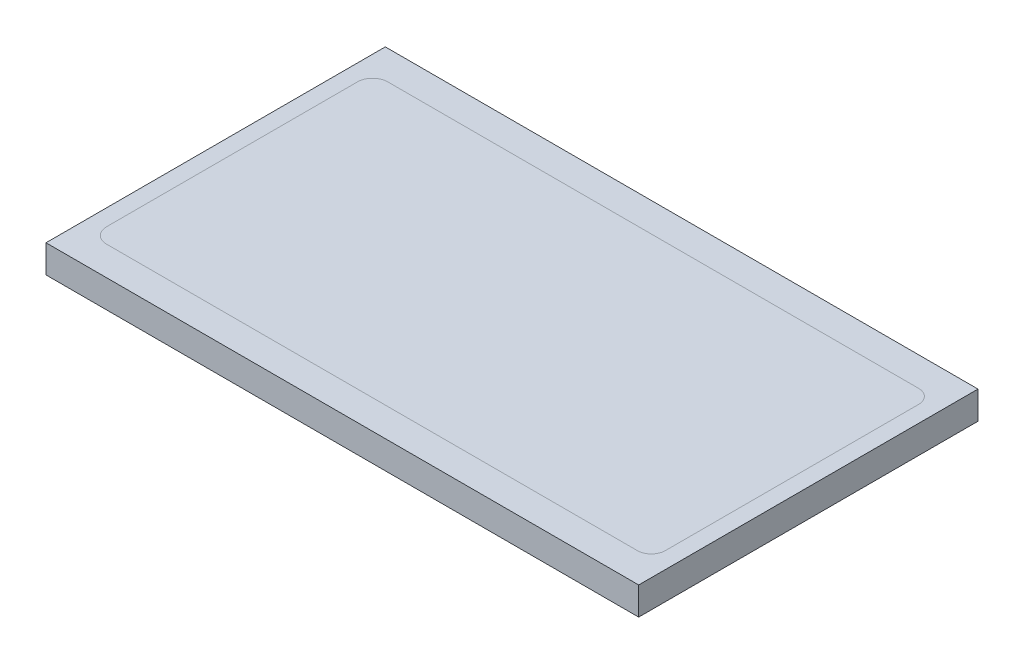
ISO-10303-21;
HEADER;
FILE_DESCRIPTION(('STEP AP214'),'2;1');
FILE_NAME('part.step','',(''),(''),'','','');
FILE_SCHEMA(('AUTOMOTIVE_DESIGN { 1 0 10303 214 1 1 1 1 }'));
ENDSEC;
DATA;
#1=APPLICATION_CONTEXT('core data for automotive mechanical design processes');
#2=APPLICATION_PROTOCOL_DEFINITION('international standard','automotive_design',2000,#1);
#3=PRODUCT_CONTEXT('',#1,'mechanical');
#4=PRODUCT('Part','Part','',(#3));
#5=PRODUCT_RELATED_PRODUCT_CATEGORY('part','',(#4));
#6=PRODUCT_DEFINITION_FORMATION('','',#4);
#7=PRODUCT_DEFINITION_CONTEXT('part definition',#1,'design');
#8=PRODUCT_DEFINITION('design','',#6,#7);
#9=PRODUCT_DEFINITION_SHAPE('','',#8);
#10=(LENGTH_UNIT() NAMED_UNIT(*) SI_UNIT(.MILLI.,.METRE.));
#11=(NAMED_UNIT(*) PLANE_ANGLE_UNIT() SI_UNIT($,.RADIAN.));
#12=(NAMED_UNIT(*) SI_UNIT($,.STERADIAN.) SOLID_ANGLE_UNIT());
#13=UNCERTAINTY_MEASURE_WITH_UNIT(LENGTH_MEASURE(1.E-05),#10,'distance_accuracy_value','');
#14=(GEOMETRIC_REPRESENTATION_CONTEXT(3) GLOBAL_UNCERTAINTY_ASSIGNED_CONTEXT((#13)) GLOBAL_UNIT_ASSIGNED_CONTEXT((#10,
#11,#12)) REPRESENTATION_CONTEXT('',''));
#15=CARTESIAN_POINT('',(0.,0.,0.));
#16=DIRECTION('',(0.,0.,1.));
#17=DIRECTION('',(1.,0.,0.));
#18=AXIS2_PLACEMENT_3D('',#15,#16,#17);
#19=CARTESIAN_POINT('',(-106.323036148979,7.27937640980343,-60.867504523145));
#20=DIRECTION('',(1.,0.,0.));
#21=DIRECTION('',(0.,0.,-1.));
#22=AXIS2_PLACEMENT_3D('',#19,#20,#21);
#23=PLANE('',#22);
#24=DIRECTION('',(0.,0.,1.));
#25=VECTOR('',#24,1.);
#26=CARTESIAN_POINT('',(-106.323036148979,-92.7206235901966,-60.867504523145));
#27=LINE('',#26,#25);
#28=CARTESIAN_POINT('',(-106.323036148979,-92.7206235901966,-60.867504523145));
#29=VERTEX_POINT('',#28);
#30=CARTESIAN_POINT('',(-106.323036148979,-92.7206235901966,60.867504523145));
#31=VERTEX_POINT('',#30);
#32=EDGE_CURVE('E59',#29,#31,#27,.T.);
#33=ORIENTED_EDGE('',*,*,#32,.F.);
#34=DIRECTION('',(0.,-1.,0.));
#35=VECTOR('',#34,1.);
#36=CARTESIAN_POINT('',(-106.323036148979,7.27937640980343,-60.867504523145));
#37=LINE('',#36,#35);
#38=CARTESIAN_POINT('',(-106.323036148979,-102.720623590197,-60.867504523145));
#39=VERTEX_POINT('',#38);
#40=EDGE_CURVE('E198',#29,#39,#37,.T.);
#41=ORIENTED_EDGE('',*,*,#40,.T.);
#42=DIRECTION('',(0.,0.,1.));
#43=VECTOR('',#42,1.);
#44=CARTESIAN_POINT('',(-106.323036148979,-102.720623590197,-60.867504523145));
#45=LINE('',#44,#43);
#46=CARTESIAN_POINT('',(-106.323036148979,-102.720623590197,60.867504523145));
#47=VERTEX_POINT('',#46);
#48=EDGE_CURVE('E186',#39,#47,#45,.T.);
#49=ORIENTED_EDGE('',*,*,#48,.T.);
#50=DIRECTION('',(0.,-1.,0.));
#51=VECTOR('',#50,1.);
#52=CARTESIAN_POINT('',(-106.323036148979,7.27937640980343,60.867504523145));
#53=LINE('',#52,#51);
#54=EDGE_CURVE('E183',#31,#47,#53,.T.);
#55=ORIENTED_EDGE('',*,*,#54,.F.);
#56=EDGE_LOOP('',(#33,#41,#49,#55));
#57=FACE_BOUND('',#56,.T.);
#58=ADVANCED_FACE('F40',(#57),#23,.F.);
#59=CARTESIAN_POINT('',(106.323036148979,7.27937640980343,60.867504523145));
#60=DIRECTION('',(0.,0.,-1.));
#61=DIRECTION('',(-1.,0.,0.));
#62=AXIS2_PLACEMENT_3D('',#59,#60,#61);
#63=PLANE('',#62);
#64=DIRECTION('',(1.,0.,0.));
#65=VECTOR('',#64,1.);
#66=CARTESIAN_POINT('',(106.323036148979,-92.7206235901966,60.867504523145));
#67=LINE('',#66,#65);
#68=CARTESIAN_POINT('',(106.323036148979,-92.7206235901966,60.867504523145));
#69=VERTEX_POINT('',#68);
#70=EDGE_CURVE('E182',#31,#69,#67,.T.);
#71=ORIENTED_EDGE('',*,*,#70,.F.);
#72=ORIENTED_EDGE('',*,*,#54,.T.);
#73=DIRECTION('',(1.,0.,0.));
#74=VECTOR('',#73,1.);
#75=CARTESIAN_POINT('',(106.323036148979,-102.720623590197,60.867504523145));
#76=LINE('',#75,#74);
#77=CARTESIAN_POINT('',(106.323036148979,-102.720623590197,60.867504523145));
#78=VERTEX_POINT('',#77);
#79=EDGE_CURVE('E189',#47,#78,#76,.T.);
#80=ORIENTED_EDGE('',*,*,#79,.T.);
#81=DIRECTION('',(0.,-1.,0.));
#82=VECTOR('',#81,1.);
#83=CARTESIAN_POINT('',(106.323036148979,7.27937640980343,60.867504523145));
#84=LINE('',#83,#82);
#85=EDGE_CURVE('E204',#69,#78,#84,.T.);
#86=ORIENTED_EDGE('',*,*,#85,.F.);
#87=EDGE_LOOP('',(#71,#72,#80,#86));
#88=FACE_BOUND('',#87,.T.);
#89=ADVANCED_FACE('F211',(#88),#63,.F.);
#90=CARTESIAN_POINT('',(106.323036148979,7.27937640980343,-60.867504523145));
#91=DIRECTION('',(-1.,0.,0.));
#92=DIRECTION('',(0.,0.,1.));
#93=AXIS2_PLACEMENT_3D('',#90,#91,#92);
#94=PLANE('',#93);
#95=DIRECTION('',(0.,0.,-1.));
#96=VECTOR('',#95,1.);
#97=CARTESIAN_POINT('',(106.323036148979,-92.7206235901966,-60.867504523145));
#98=LINE('',#97,#96);
#99=CARTESIAN_POINT('',(106.323036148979,-92.7206235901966,-60.867504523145));
#100=VERTEX_POINT('',#99);
#101=EDGE_CURVE('E174',#69,#100,#98,.T.);
#102=ORIENTED_EDGE('',*,*,#101,.F.);
#103=ORIENTED_EDGE('',*,*,#85,.T.);
#104=DIRECTION('',(0.,0.,-1.));
#105=VECTOR('',#104,1.);
#106=CARTESIAN_POINT('',(106.323036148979,-102.720623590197,-60.867504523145));
#107=LINE('',#106,#105);
#108=CARTESIAN_POINT('',(106.323036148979,-102.720623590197,-60.867504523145));
#109=VERTEX_POINT('',#108);
#110=EDGE_CURVE('E192',#78,#109,#107,.T.);
#111=ORIENTED_EDGE('',*,*,#110,.T.);
#112=DIRECTION('',(0.,-1.,0.));
#113=VECTOR('',#112,1.);
#114=CARTESIAN_POINT('',(106.323036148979,7.27937640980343,-60.867504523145));
#115=LINE('',#114,#113);
#116=EDGE_CURVE('E201',#100,#109,#115,.T.);
#117=ORIENTED_EDGE('',*,*,#116,.F.);
#118=EDGE_LOOP('',(#102,#103,#111,#117));
#119=FACE_BOUND('',#118,.T.);
#120=ADVANCED_FACE('F234',(#119),#94,.F.);
#121=CARTESIAN_POINT('',(106.323036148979,7.27937640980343,-60.867504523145));
#122=DIRECTION('',(0.,0.,1.));
#123=DIRECTION('',(1.,0.,0.));
#124=AXIS2_PLACEMENT_3D('',#121,#122,#123);
#125=PLANE('',#124);
#126=DIRECTION('',(-1.,0.,0.));
#127=VECTOR('',#126,1.);
#128=CARTESIAN_POINT('',(106.323036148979,-92.7206235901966,-60.867504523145));
#129=LINE('',#128,#127);
#130=EDGE_CURVE('E43',#100,#29,#129,.T.);
#131=ORIENTED_EDGE('',*,*,#130,.F.);
#132=ORIENTED_EDGE('',*,*,#116,.T.);
#133=DIRECTION('',(-1.,0.,0.));
#134=VECTOR('',#133,1.);
#135=CARTESIAN_POINT('',(106.323036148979,-102.720623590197,-60.867504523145));
#136=LINE('',#135,#134);
#137=EDGE_CURVE('E195',#109,#39,#136,.T.);
#138=ORIENTED_EDGE('',*,*,#137,.T.);
#139=ORIENTED_EDGE('',*,*,#40,.F.);
#140=EDGE_LOOP('',(#131,#132,#138,#139));
#141=FACE_BOUND('',#140,.T.);
#142=ADVANCED_FACE('F228',(#141),#125,.F.);
#143=CARTESIAN_POINT('',(0.,-102.720623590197,0.));
#144=DIRECTION('',(0.,-1.,0.));
#145=DIRECTION('',(0.,0.,-1.));
#146=AXIS2_PLACEMENT_3D('',#143,#144,#145);
#147=PLANE('',#146);
#148=ORIENTED_EDGE('',*,*,#48,.F.);
#149=ORIENTED_EDGE('',*,*,#137,.F.);
#150=ORIENTED_EDGE('',*,*,#110,.F.);
#151=ORIENTED_EDGE('',*,*,#79,.F.);
#152=EDGE_LOOP('',(#148,#149,#150,#151));
#153=FACE_BOUND('',#152,.T.);
#154=ADVANCED_FACE('F219',(#153),#147,.T.);
#155=CARTESIAN_POINT('',(95.4365337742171,-92.7206235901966,-50.4363433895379));
#156=DIRECTION('',(0.,1.,0.));
#157=DIRECTION('',(0.707106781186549,0.,0.707106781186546));
#158=AXIS2_PLACEMENT_3D('',#155,#156,#157);
#159=PLANE('',#158);
#160=CARTESIAN_POINT('',(95.4365337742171,-92.7206235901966,-50.4363433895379));
#161=CARTESIAN_POINT('',(95.9287077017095,-92.7206235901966,-50.4363433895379));
#162=CARTESIAN_POINT('',(96.4119685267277,-92.7206235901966,-50.3402754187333));
#163=CARTESIAN_POINT('',(96.8944226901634,-92.7206235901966,-50.244367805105));
#164=CARTESIAN_POINT('',(97.3499068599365,-92.7206235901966,-50.0557629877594));
#165=CARTESIAN_POINT('',(97.8043747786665,-92.7206235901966,-49.8675789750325));
#166=CARTESIAN_POINT('',(98.2143078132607,-92.7206235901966,-49.5937386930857));
#167=CARTESIAN_POINT('',(98.6233262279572,-92.7206235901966,-49.3205093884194));
#168=CARTESIAN_POINT('',(98.9719561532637,-92.7206235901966,-48.9719561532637));
#169=CARTESIAN_POINT('',(99.3198082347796,-92.7206235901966,-48.6241805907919));
#170=CARTESIAN_POINT('',(99.5937386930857,-92.7206235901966,-48.2143078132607));
#171=CARTESIAN_POINT('',(99.8670579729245,-92.7206235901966,-47.8053495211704));
#172=CARTESIAN_POINT('',(100.055762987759,-92.7206235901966,-47.3499068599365));
#173=CARTESIAN_POINT('',(100.244046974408,-92.7206235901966,-46.8954803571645));
#174=CARTESIAN_POINT('',(100.340275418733,-92.7206235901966,-46.4119685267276));
#175=CARTESIAN_POINT('',(100.436343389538,-92.7206235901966,-45.9292630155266));
#176=CARTESIAN_POINT('',(100.436343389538,-92.7206235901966,-45.4365337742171));
#177=B_SPLINE_CURVE_WITH_KNOTS('',2,(#160,#161,#162,#163,#164,#165,#166,#167,#168,#169,#170,
#171,#172,#173,#174,#175,#176),.UNSPECIFIED.,.F.,.F.,(3,2,2,2,2,2,2,2,3),(0.,0.125,0.25,0.375,
0.5,0.625,0.75,0.875,1.),.UNSPECIFIED.);
#178=CARTESIAN_POINT('',(95.4365337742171,-92.7206235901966,-50.4363433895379));
#179=VERTEX_POINT('',#178);
#180=CARTESIAN_POINT('',(100.436343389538,-92.7206235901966,-45.4365337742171));
#181=VERTEX_POINT('',#180);
#182=EDGE_CURVE('E156',#179,#181,#177,.T.);
#183=ORIENTED_EDGE('',*,*,#182,.T.);
#184=DIRECTION('',(0.,0.,1.));
#185=VECTOR('',#184,1.);
#186=CARTESIAN_POINT('',(100.436343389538,-92.7206235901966,50.));
#187=LINE('',#186,#185);
#188=CARTESIAN_POINT('',(100.436343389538,-92.7206235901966,45.4365337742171));
#189=VERTEX_POINT('',#188);
#190=EDGE_CURVE('E11',#189,#181,#187,.F.);
#191=ORIENTED_EDGE('',*,*,#190,.F.);
#192=CARTESIAN_POINT('',(100.436343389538,-92.7206235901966,45.4365337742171));
#193=CARTESIAN_POINT('',(100.436343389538,-92.7206235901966,45.928707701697));
#194=CARTESIAN_POINT('',(100.340275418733,-92.7206235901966,46.4119685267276));
#195=CARTESIAN_POINT('',(100.24436780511,-92.7206235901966,46.8944226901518));
#196=CARTESIAN_POINT('',(100.055762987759,-92.7206235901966,47.3499068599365));
#197=CARTESIAN_POINT('',(99.8675789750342,-92.7206235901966,47.8043747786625));
#198=CARTESIAN_POINT('',(99.5937386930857,-92.7206235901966,48.2143078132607));
#199=CARTESIAN_POINT('',(99.3205093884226,-92.7206235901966,48.623326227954));
#200=CARTESIAN_POINT('',(98.9719561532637,-92.7206235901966,48.9719561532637));
#201=CARTESIAN_POINT('',(98.6241805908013,-92.7206235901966,49.3198082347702));
#202=CARTESIAN_POINT('',(98.2143078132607,-92.7206235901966,49.5937386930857));
#203=CARTESIAN_POINT('',(97.8053495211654,-92.7206235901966,49.867057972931));
#204=CARTESIAN_POINT('',(97.3499068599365,-92.7206235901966,50.0557629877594));
#205=CARTESIAN_POINT('',(96.8954803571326,-92.7206235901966,50.2440469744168));
#206=CARTESIAN_POINT('',(96.4119685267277,-92.7206235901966,50.3402754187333));
#207=CARTESIAN_POINT('',(95.9292630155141,-92.7206235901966,50.436343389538));
#208=CARTESIAN_POINT('',(95.4365337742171,-92.7206235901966,50.436343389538));
#209=B_SPLINE_CURVE_WITH_KNOTS('',2,(#192,#193,#194,#195,#196,#197,#198,#199,#200,#201,#202,
#203,#204,#205,#206,#207,#208),.UNSPECIFIED.,.F.,.F.,(3,2,2,2,2,2,2,2,3),(0.,0.125,0.25,0.375,
0.5,0.625,0.75,0.875,1.),.UNSPECIFIED.);
#210=CARTESIAN_POINT('',(95.4365337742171,-92.7206235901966,50.436343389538));
#211=VERTEX_POINT('',#210);
#212=EDGE_CURVE('E50',#189,#211,#209,.T.);
#213=ORIENTED_EDGE('',*,*,#212,.T.);
#214=DIRECTION('',(-1.,0.,0.));
#215=VECTOR('',#214,1.);
#216=CARTESIAN_POINT('',(100.,-92.7206235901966,50.436343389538));
#217=LINE('',#216,#215);
#218=CARTESIAN_POINT('',(-95.,-92.7206235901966,50.436343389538));
#219=VERTEX_POINT('',#218);
#220=EDGE_CURVE('E88',#219,#211,#217,.F.);
#221=ORIENTED_EDGE('',*,*,#220,.F.);
#222=CARTESIAN_POINT('',(-95.,-92.7206235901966,50.436343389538));
#223=CARTESIAN_POINT('',(-95.5331322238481,-92.7206235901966,50.436343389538));
#224=CARTESIAN_POINT('',(-96.0592902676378,-92.7206235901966,50.3318050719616));
#225=CARTESIAN_POINT('',(-96.5869137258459,-92.7206235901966,50.2269756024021));
#226=CARTESIAN_POINT('',(-97.080813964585,-92.7206235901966,50.0223397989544));
#227=CARTESIAN_POINT('',(-97.5720463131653,-92.7206235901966,49.8188093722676));
#228=CARTESIAN_POINT('',(-98.0171713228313,-92.7206235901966,49.5217879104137));
#229=CARTESIAN_POINT('',(-98.4648475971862,-92.7206235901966,49.2230640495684));
#230=CARTESIAN_POINT('',(-98.8430906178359,-92.7206235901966,48.8450039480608));
#231=CARTESIAN_POINT('',(-99.2193590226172,-92.7206235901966,48.4689175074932));
#232=CARTESIAN_POINT('',(-99.5171988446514,-92.7206235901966,48.0240010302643));
#233=CARTESIAN_POINT('',(-99.816071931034,-92.7206235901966,47.5775410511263));
#234=CARTESIAN_POINT('',(-100.020790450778,-92.7206235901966,47.0844670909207));
#235=CARTESIAN_POINT('',(-100.225475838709,-92.7206235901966,46.5914729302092));
#236=CARTESIAN_POINT('',(-100.330693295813,-92.7206235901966,46.0647364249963));
#237=CARTESIAN_POINT('',(-100.436343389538,-92.7206235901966,45.5358340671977));
#238=CARTESIAN_POINT('',(-100.436343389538,-92.7206235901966,44.9998096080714));
#239=B_SPLINE_CURVE_WITH_KNOTS('',2,(#222,#223,#224,#225,#226,#227,#228,#229,#230,#231,#232,
#233,#234,#235,#236,#237,#238),.UNSPECIFIED.,.F.,.F.,(3,2,2,2,2,2,2,2,3),(0.,0.125,0.25,0.375,
0.5,0.625,0.75,0.875,1.),.UNSPECIFIED.);
#240=CARTESIAN_POINT('',(-100.436343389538,-92.7206235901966,44.9998096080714));
#241=VERTEX_POINT('',#240);
#242=EDGE_CURVE('E85',#219,#241,#239,.T.);
#243=ORIENTED_EDGE('',*,*,#242,.T.);
#244=DIRECTION('',(0.,0.,-1.));
#245=VECTOR('',#244,1.);
#246=CARTESIAN_POINT('',(-100.436343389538,-92.7206235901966,50.));
#247=LINE('',#246,#245);
#248=CARTESIAN_POINT('',(-100.436343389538,-92.7206235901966,-44.9998096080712));
#249=VERTEX_POINT('',#248);
#250=EDGE_CURVE('E92',#249,#241,#247,.F.);
#251=ORIENTED_EDGE('',*,*,#250,.F.);
#252=CARTESIAN_POINT('',(-100.436343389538,-92.7206235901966,-44.9998096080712));
#253=CARTESIAN_POINT('',(-100.436343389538,-92.7206235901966,-45.5335177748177));
#254=CARTESIAN_POINT('',(-100.33159293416,-92.7206235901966,-46.0602227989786));
#255=CARTESIAN_POINT('',(-100.226547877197,-92.7206235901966,-46.5884091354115));
#256=CARTESIAN_POINT('',(-100.02149957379,-92.7206235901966,-47.0827583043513));
#257=CARTESIAN_POINT('',(-99.8175537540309,-92.7206235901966,-47.5744495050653));
#258=CARTESIAN_POINT('',(-99.5199592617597,-92.7206235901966,-48.0198734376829));
#259=CARTESIAN_POINT('',(-99.2206458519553,-92.7206235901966,-48.4678701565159));
#260=CARTESIAN_POINT('',(-98.8418902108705,-92.7206235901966,-48.8462033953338));
#261=CARTESIAN_POINT('',(-98.4650688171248,-92.7206235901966,-49.2226045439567));
#262=CARTESIAN_POINT('',(-98.0193684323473,-92.7206235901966,-49.5203210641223));
#263=CARTESIAN_POINT('',(-97.5721287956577,-92.7206235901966,-49.8190657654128));
#264=CARTESIAN_POINT('',(-97.0783153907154,-92.7206235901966,-50.0233742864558));
#265=CARTESIAN_POINT('',(-96.5845350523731,-92.7206235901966,-50.2276691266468));
#266=CARTESIAN_POINT('',(-96.0571234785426,-92.7206235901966,-50.3322351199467));
#267=CARTESIAN_POINT('',(-95.5320205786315,-92.7206235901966,-50.4363433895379));
#268=CARTESIAN_POINT('',(-95.,-92.7206235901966,-50.4363433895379));
#269=B_SPLINE_CURVE_WITH_KNOTS('',2,(#252,#253,#254,#255,#256,#257,#258,#259,#260,#261,#262,
#263,#264,#265,#266,#267,#268),.UNSPECIFIED.,.F.,.F.,(3,2,2,2,2,2,2,2,3),(0.,0.125,0.25,0.375,
0.5,0.625,0.75,0.875,1.),.UNSPECIFIED.);
#270=CARTESIAN_POINT('',(-95.,-92.7206235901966,-50.4363433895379));
#271=VERTEX_POINT('',#270);
#272=EDGE_CURVE('E125',#249,#271,#269,.T.);
#273=ORIENTED_EDGE('',*,*,#272,.T.);
#274=DIRECTION('',(1.,0.,0.));
#275=VECTOR('',#274,1.);
#276=CARTESIAN_POINT('',(100.,-92.7206235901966,-50.4363433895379));
#277=LINE('',#276,#275);
#278=EDGE_CURVE('E130',#179,#271,#277,.F.);
#279=ORIENTED_EDGE('',*,*,#278,.F.);
#280=EDGE_LOOP('',(#183,#191,#213,#221,#243,#251,#273,#279));
#281=FACE_BOUND('',#280,.T.);
#282=ORIENTED_EDGE('',*,*,#32,.T.);
#283=ORIENTED_EDGE('',*,*,#70,.T.);
#284=ORIENTED_EDGE('',*,*,#101,.T.);
#285=ORIENTED_EDGE('',*,*,#130,.T.);
#286=EDGE_LOOP('',(#282,#283,#284,#285));
#287=FACE_BOUND('',#286,.T.);
#288=ADVANCED_FACE('F97',(#281,#287),#159,.T.);
#289=CARTESIAN_POINT('',(0.,-92.7206235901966,0.));
#290=DIRECTION('',(0.,1.,0.));
#291=DIRECTION('',(0.,0.,1.));
#292=AXIS2_PLACEMENT_3D('',#289,#290,#291);
#293=PLANE('',#292);
#294=ORIENTED_EDGE('',*,*,#278,.T.);
#295=ORIENTED_EDGE('',*,*,#272,.F.);
#296=ORIENTED_EDGE('',*,*,#250,.T.);
#297=ORIENTED_EDGE('',*,*,#242,.F.);
#298=ORIENTED_EDGE('',*,*,#220,.T.);
#299=ORIENTED_EDGE('',*,*,#212,.F.);
#300=ORIENTED_EDGE('',*,*,#190,.T.);
#301=ORIENTED_EDGE('',*,*,#182,.F.);
#302=EDGE_LOOP('',(#294,#295,#296,#297,#298,#299,#300,#301));
#303=FACE_BOUND('',#302,.T.);
#304=ADVANCED_FACE('F87',(#303),#293,.T.);
#305=CLOSED_SHELL('',(#58,#89,#120,#142,#154,#288,#304));
#306=MANIFOLD_SOLID_BREP('B2',#305);
#307=ADVANCED_BREP_SHAPE_REPRESENTATION('',(#18,#306),#14);
#308=SHAPE_DEFINITION_REPRESENTATION(#9,#307);
ENDSEC;
END-ISO-10303-21;
